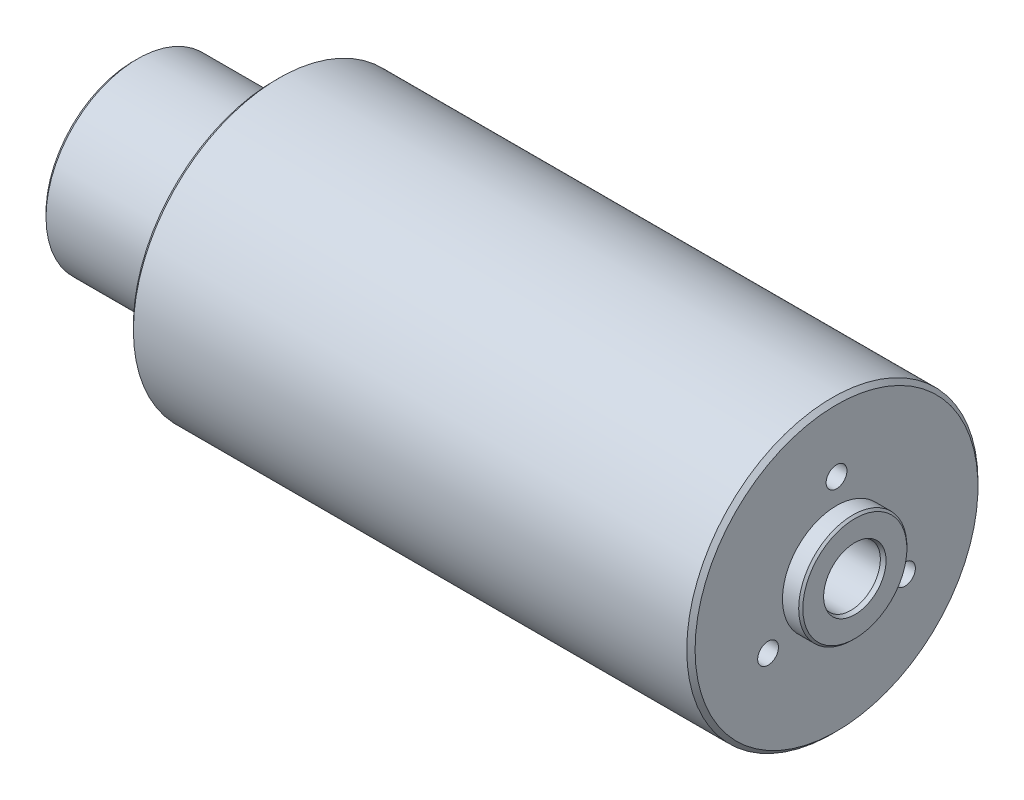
from build123d import *

# Parameters (mm, degrees)
CHANFREIN2_SIZE                   = 0.25
R_P_TITION_CIRCULAIRE1_COUNT      = 3
CHANFREIN3_SIZE                   = 0.5
D_GAGEMENT_POUR_M6_51_D           = 7.1
D_GAGEMENT_POUR_M6_51_DEPTH       = 20
D_GAGEMENT_POUR_M6_51_CSINK_D     = 7.5
D_GAGEMENT_POUR_M6_51_CSINK_ANGLE = 45
D_GAGEMENT_POUR_M6_51_TIP         = 2.133055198


with BuildPart() as part:
    # Esquisse1 → Base-R_volution (revolve)
    with BuildSketch(Plane.XY, mode=Mode.PRIVATE) as base_r_volution_sk:
        Polygon((2.2, 0), (2.2, 6.5), (0, 6.5), (0, 17.5), (-67.500713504, 17.5), (-67.500713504, 11), (-84.500713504, 11), (-84.500713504, 0), align=None)
    revolve(base_r_volution_sk.sketch.rotate(Axis((-71.12515213, 0, 0), (1, 0, 0)), 90), axis=Axis((-71.12515213, 0, 0), (1, 0, 0)))

    # Chanfrein2
    chanfrein2_edges = [part.edges().sort_by_distance(p)[0] for p in [
        (2.2, 0, -6.5),
    ]]
    chamfer(chanfrein2_edges, length=CHANFREIN2_SIZE)

    # Esquisse2 → Trou taraud_ M2.5x0.451 (revolve, cut)
    with BuildSketch(Plane(origin=(0, 9.5, 0), x_dir=(0, 0, -1), z_dir=(0, 1, 0))):
        Polygon((0, 0), (0, 7.365882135), (1.025, 6.75), (1.025, 4.5), (1.25, 4.5), (1.25, 0), align=None)
    trou_taraud_m2_5x0_451 = revolve(axis=Axis((6.35, 9.5, 0), (-1, 0, 0)), mode=Mode.SUBTRACT)

    # R_p_tition circulaire1: Trou taraud_ M2.5x0.451 ×3 about axis
    r_p_tition_circulaire1_axis = Axis((0, 0, 0), (1, 0, 0))
    for i in range(1, R_P_TITION_CIRCULAIRE1_COUNT):
        add(trou_taraud_m2_5x0_451.rotate(r_p_tition_circulaire1_axis, i * 360 / R_P_TITION_CIRCULAIRE1_COUNT), mode=Mode.SUBTRACT)

    # Chanfrein3
    chanfrein3_edges = [part.edges().sort_by_distance(p)[0] for p in [
        (0, 0, -17.5),
        (-67.500713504, 0, -17.5),
        (-84.500713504, 0, -11),
    ]]
    chamfer(chanfrein3_edges, length=CHANFREIN3_SIZE)

    # D_gagement pour M6.51
    with Locations(Plane(origin=(2.2, 0, 0), x_dir=(0, 0, -1), z_dir=(1, 0, 0))):
        with Locations((0, 0)):
            CounterSinkHole(D_GAGEMENT_POUR_M6_51_D / 2, D_GAGEMENT_POUR_M6_51_CSINK_D / 2, depth=D_GAGEMENT_POUR_M6_51_DEPTH, counter_sink_angle=D_GAGEMENT_POUR_M6_51_CSINK_ANGLE)
            with Locations((0, 0, -(D_GAGEMENT_POUR_M6_51_DEPTH + D_GAGEMENT_POUR_M6_51_TIP / 2))):  # 118° drill point
                Cone(0, D_GAGEMENT_POUR_M6_51_D / 2, D_GAGEMENT_POUR_M6_51_TIP, mode=Mode.SUBTRACT)


solid = part.part
